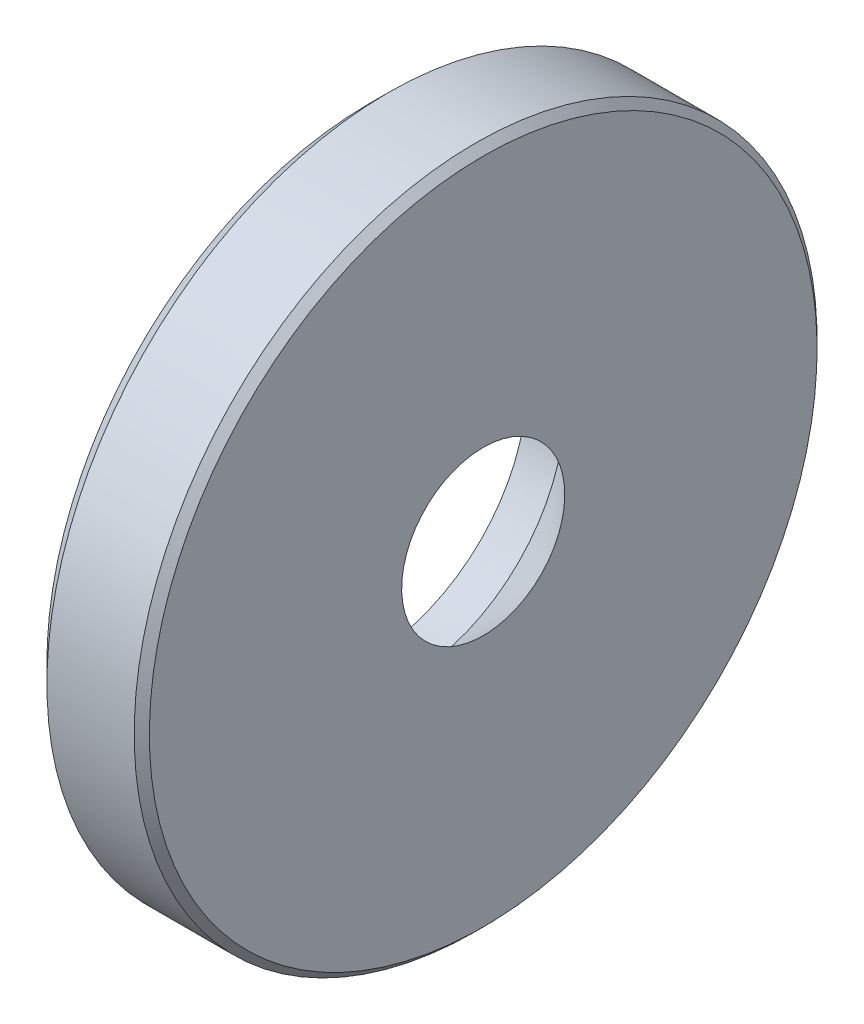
ISO-10303-21;
HEADER;
FILE_DESCRIPTION(('STEP AP214'),'2;1');
FILE_NAME('part.step','',(''),(''),'','','');
FILE_SCHEMA(('AUTOMOTIVE_DESIGN { 1 0 10303 214 1 1 1 1 }'));
ENDSEC;
DATA;
#1=APPLICATION_CONTEXT('core data for automotive mechanical design processes');
#2=APPLICATION_PROTOCOL_DEFINITION('international standard','automotive_design',2000,#1);
#3=PRODUCT_CONTEXT('',#1,'mechanical');
#4=PRODUCT('Part','Part','',(#3));
#5=PRODUCT_RELATED_PRODUCT_CATEGORY('part','',(#4));
#6=PRODUCT_DEFINITION_FORMATION('','',#4);
#7=PRODUCT_DEFINITION_CONTEXT('part definition',#1,'design');
#8=PRODUCT_DEFINITION('design','',#6,#7);
#9=PRODUCT_DEFINITION_SHAPE('','',#8);
#10=(LENGTH_UNIT() NAMED_UNIT(*) SI_UNIT(.MILLI.,.METRE.));
#11=(NAMED_UNIT(*) PLANE_ANGLE_UNIT() SI_UNIT($,.RADIAN.));
#12=(NAMED_UNIT(*) SI_UNIT($,.STERADIAN.) SOLID_ANGLE_UNIT());
#13=UNCERTAINTY_MEASURE_WITH_UNIT(LENGTH_MEASURE(1.E-05),#10,'distance_accuracy_value','');
#14=(GEOMETRIC_REPRESENTATION_CONTEXT(3) GLOBAL_UNCERTAINTY_ASSIGNED_CONTEXT((#13)) GLOBAL_UNIT_ASSIGNED_CONTEXT((#10,
#11,#12)) REPRESENTATION_CONTEXT('',''));
#15=CARTESIAN_POINT('',(0.,0.,0.));
#16=DIRECTION('',(0.,0.,1.));
#17=DIRECTION('',(1.,0.,0.));
#18=AXIS2_PLACEMENT_3D('',#15,#16,#17);
#19=DIRECTION('',(-0.707106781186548,0.707106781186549,0.));
#20=VECTOR('',#19,1.);
#21=CARTESIAN_POINT('',(-499000.,498917.150000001,-86.000000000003));
#22=LINE('',#21,#20);
#23=CARTESIAN_POINT('',(-116.85,34.0000000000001,-86.0000000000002));
#24=DIRECTION('',(-1.,0.,0.));
#25=AXIS1_PLACEMENT('',#23,#24);
#26=SURFACE_OF_REVOLUTION('',#22,#25);
#27=CARTESIAN_POINT('',(-119.,34.0000000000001,-86.0000000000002));
#28=DIRECTION('',(-1.,0.,0.));
#29=DIRECTION('',(0.,1.,0.));
#30=AXIS2_PLACEMENT_3D('',#27,#28,#29);
#31=CIRCLE('',#30,2.15);
#32=CARTESIAN_POINT('',(-119.,36.1500000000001,-86.0000000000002));
#33=VERTEX_POINT('',#32);
#34=EDGE_CURVE('E65',#33,#33,#31,.T.);
#35=ORIENTED_EDGE('',*,*,#34,.F.);
#36=EDGE_LOOP('',(#35));
#37=FACE_BOUND('',#36,.T.);
#38=CARTESIAN_POINT('',(-121.,34.0000000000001,-86.0000000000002));
#39=DIRECTION('',(-1.,0.,0.));
#40=DIRECTION('',(0.,1.,0.));
#41=AXIS2_PLACEMENT_3D('',#38,#39,#40);
#42=CIRCLE('',#41,4.15);
#43=CARTESIAN_POINT('',(-121.,38.1500000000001,-86.0000000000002));
#44=VERTEX_POINT('',#43);
#45=EDGE_CURVE('E75',#44,#44,#42,.T.);
#46=ORIENTED_EDGE('',*,*,#45,.T.);
#47=EDGE_LOOP('',(#46));
#48=FACE_BOUND('',#47,.T.);
#49=ADVANCED_FACE('F12',(#37,#48),#26,.F.);
#50=CARTESIAN_POINT('',(-121.5,34.0000000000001,-86.0000000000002));
#51=DIRECTION('',(1.,0.,0.));
#52=DIRECTION('',(0.,0.,-1.));
#53=AXIS2_PLACEMENT_3D('',#50,#51,#52);
#54=CYLINDRICAL_SURFACE('',#53,4.15);
#55=ORIENTED_EDGE('',*,*,#45,.F.);
#56=EDGE_LOOP('',(#55));
#57=FACE_BOUND('',#56,.T.);
#58=CARTESIAN_POINT('',(-122.,34.0000000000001,-86.0000000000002));
#59=DIRECTION('',(-1.,0.,0.));
#60=DIRECTION('',(0.,1.,0.));
#61=AXIS2_PLACEMENT_3D('',#58,#59,#60);
#62=CIRCLE('',#61,4.15);
#63=CARTESIAN_POINT('',(-122.,38.1500000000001,-86.0000000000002));
#64=VERTEX_POINT('',#63);
#65=EDGE_CURVE('E8',#64,#64,#62,.T.);
#66=ORIENTED_EDGE('',*,*,#65,.T.);
#67=EDGE_LOOP('',(#66));
#68=FACE_BOUND('',#67,.T.);
#69=ADVANCED_FACE('F14',(#57,#68),#54,.F.);
#70=CARTESIAN_POINT('',(-122.,40.3250000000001,-86.0000000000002));
#71=DIRECTION('',(-1.,0.,0.));
#72=DIRECTION('',(0.,0.,1.));
#73=AXIS2_PLACEMENT_3D('',#70,#71,#72);
#74=PLANE('',#73);
#75=CARTESIAN_POINT('',(-122.,34.0000000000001,-86.0000000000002));
#76=DIRECTION('',(-1.,0.,0.));
#77=DIRECTION('',(0.,1.,0.));
#78=AXIS2_PLACEMENT_3D('',#75,#76,#77);
#79=CIRCLE('',#78,8.5);
#80=CARTESIAN_POINT('',(-122.,42.5000000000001,-86.0000000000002));
#81=VERTEX_POINT('',#80);
#82=EDGE_CURVE('E21',#81,#81,#79,.T.);
#83=ORIENTED_EDGE('',*,*,#82,.T.);
#84=EDGE_LOOP('',(#83));
#85=FACE_BOUND('',#84,.T.);
#86=ORIENTED_EDGE('',*,*,#65,.F.);
#87=EDGE_LOOP('',(#86));
#88=FACE_BOUND('',#87,.T.);
#89=ADVANCED_FACE('F42',(#85,#88),#74,.T.);
#90=DIRECTION('',(-0.707106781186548,-0.707106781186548,0.));
#91=VECTOR('',#90,1.);
#92=CARTESIAN_POINT('',(-121.75,42.7500000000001,-86.0000000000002));
#93=LINE('',#92,#91);
#94=CARTESIAN_POINT('',(-130.5,34.0000000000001,-86.0000000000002));
#95=DIRECTION('',(1.,0.,0.));
#96=AXIS1_PLACEMENT('',#94,#95);
#97=SURFACE_OF_REVOLUTION('',#93,#96);
#98=CARTESIAN_POINT('',(-121.5,34.0000000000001,-86.0000000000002));
#99=DIRECTION('',(-1.,0.,0.));
#100=DIRECTION('',(0.,1.,0.));
#101=AXIS2_PLACEMENT_3D('',#98,#99,#100);
#102=CIRCLE('',#101,9.);
#103=CARTESIAN_POINT('',(-121.5,43.0000000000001,-86.0000000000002));
#104=VERTEX_POINT('',#103);
#105=EDGE_CURVE('E30',#104,#104,#102,.T.);
#106=ORIENTED_EDGE('',*,*,#105,.T.);
#107=EDGE_LOOP('',(#106));
#108=FACE_BOUND('',#107,.T.);
#109=ORIENTED_EDGE('',*,*,#82,.F.);
#110=EDGE_LOOP('',(#109));
#111=FACE_BOUND('',#110,.T.);
#112=ADVANCED_FACE('F45',(#108,#111),#97,.F.);
#113=CARTESIAN_POINT('',(-120.35,34.0000000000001,-86.0000000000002));
#114=DIRECTION('',(1.,0.,0.));
#115=DIRECTION('',(0.,0.,-1.));
#116=AXIS2_PLACEMENT_3D('',#113,#114,#115);
#117=CYLINDRICAL_SURFACE('',#116,9.);
#118=CARTESIAN_POINT('',(-119.2,34.0000000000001,-86.0000000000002));
#119=DIRECTION('',(-1.,0.,0.));
#120=DIRECTION('',(0.,1.,0.));
#121=AXIS2_PLACEMENT_3D('',#118,#119,#120);
#122=CIRCLE('',#121,9.);
#123=CARTESIAN_POINT('',(-119.2,43.0000000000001,-86.0000000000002));
#124=VERTEX_POINT('',#123);
#125=EDGE_CURVE('E34',#124,#124,#122,.T.);
#126=ORIENTED_EDGE('',*,*,#125,.T.);
#127=EDGE_LOOP('',(#126));
#128=FACE_BOUND('',#127,.T.);
#129=ORIENTED_EDGE('',*,*,#105,.F.);
#130=EDGE_LOOP('',(#129));
#131=FACE_BOUND('',#130,.T.);
#132=ADVANCED_FACE('F49',(#128,#131),#117,.T.);
#133=DIRECTION('',(0.707106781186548,-0.707106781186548,0.));
#134=VECTOR('',#133,1.);
#135=CARTESIAN_POINT('',(-119.1,42.9000000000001,-86.0000000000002));
#136=LINE('',#135,#134);
#137=CARTESIAN_POINT('',(-110.2,34.0000000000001,-86.0000000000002));
#138=DIRECTION('',(-1.,0.,0.));
#139=AXIS1_PLACEMENT('',#137,#138);
#140=SURFACE_OF_REVOLUTION('',#136,#139);
#141=CARTESIAN_POINT('',(-119.,34.0000000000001,-86.0000000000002));
#142=DIRECTION('',(-1.,0.,0.));
#143=DIRECTION('',(0.,1.,0.));
#144=AXIS2_PLACEMENT_3D('',#141,#142,#143);
#145=CIRCLE('',#144,8.8);
#146=CARTESIAN_POINT('',(-119.,42.8000000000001,-86.0000000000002));
#147=VERTEX_POINT('',#146);
#148=EDGE_CURVE('E68',#147,#147,#145,.T.);
#149=ORIENTED_EDGE('',*,*,#148,.T.);
#150=EDGE_LOOP('',(#149));
#151=FACE_BOUND('',#150,.T.);
#152=ORIENTED_EDGE('',*,*,#125,.F.);
#153=EDGE_LOOP('',(#152));
#154=FACE_BOUND('',#153,.T.);
#155=ADVANCED_FACE('F53',(#151,#154),#140,.F.);
#156=CARTESIAN_POINT('',(-119.,39.4750000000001,-86.0000000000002));
#157=DIRECTION('',(1.,0.,0.));
#158=DIRECTION('',(0.,0.,-1.));
#159=AXIS2_PLACEMENT_3D('',#156,#157,#158);
#160=PLANE('',#159);
#161=ORIENTED_EDGE('',*,*,#34,.T.);
#162=EDGE_LOOP('',(#161));
#163=FACE_BOUND('',#162,.T.);
#164=ORIENTED_EDGE('',*,*,#148,.F.);
#165=EDGE_LOOP('',(#164));
#166=FACE_BOUND('',#165,.T.);
#167=ADVANCED_FACE('F56',(#163,#166),#160,.T.);
#168=CLOSED_SHELL('',(#49,#69,#89,#112,#132,#155,#167));
#169=MANIFOLD_SOLID_BREP('B1',#168);
#170=ADVANCED_BREP_SHAPE_REPRESENTATION('',(#18,#169),#14);
#171=SHAPE_DEFINITION_REPRESENTATION(#9,#170);
ENDSEC;
END-ISO-10303-21;
